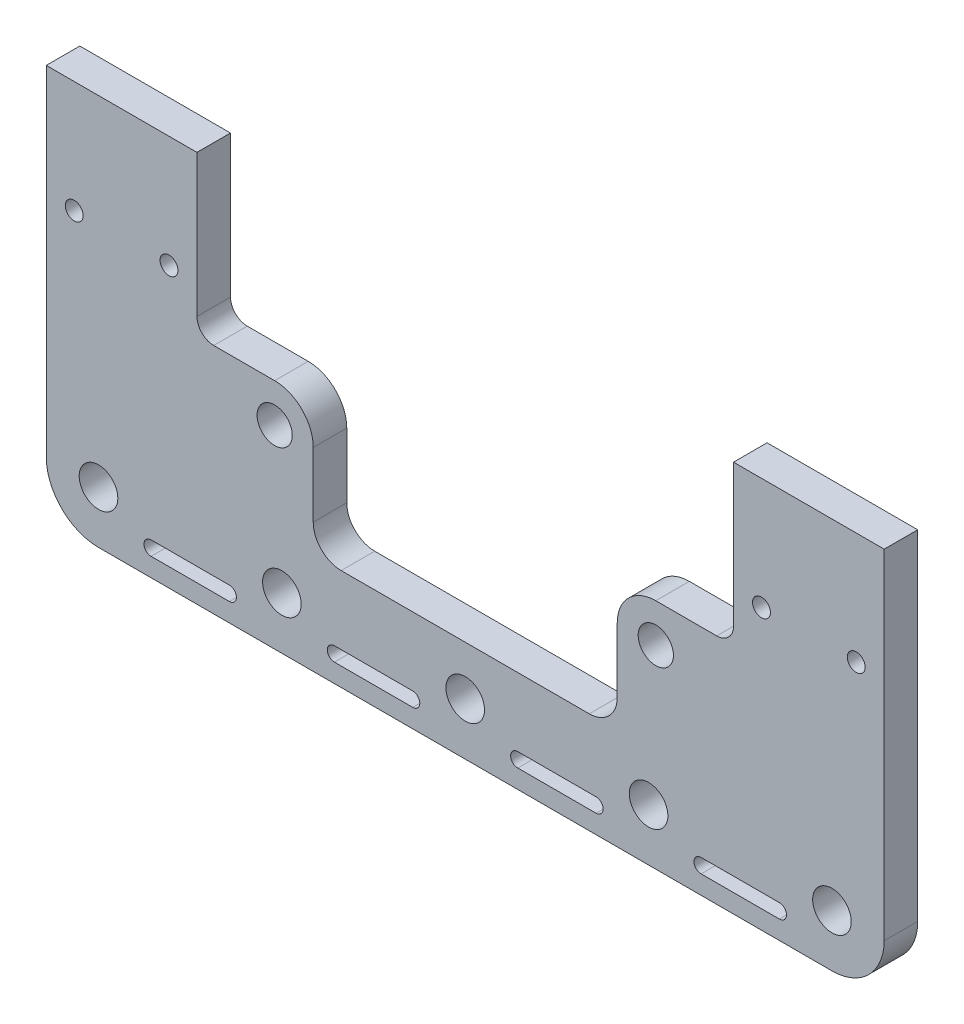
from build123d import *

# Parameters (mm, degrees)
MODEL_R             = 3.15
MODEL_R_2           = 1.6
MODEL_R_3           = 3.452065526
BOSS_EXTRUDE1_DEPTH = 6


with BuildPart() as part:
    # Model → Boss-Extrude1 (new body)
    with BuildSketch(Plane.XY):
        with BuildLine():
            Line((272.99041559, 270.71720563), (272.99041559, 210.062171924))
            ThreePointArc((272.99041559, 210.062171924), (270.253338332, 203.454282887), (263.645449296, 200.71720563))
            Line((263.645449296, 200.71720563), (132.465378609, 200.71720563))
            ThreePointArc((132.465378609, 200.71720563), (125.857489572, 203.454282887), (123.120412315, 210.062171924))
            Line((123.120412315, 210.062171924), (123.120412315, 270.71720563))
            Line((123.120412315, 270.71720563), (150.070412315, 270.71720563))
            Line((150.070412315, 270.71720563), (150.070412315, 245.302023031))
            ThreePointArc((150.070412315, 245.302023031), (150.949091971, 243.180702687), (153.070412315, 242.302023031))
            Line((153.070412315, 242.302023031), (163.970280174, 242.302023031))
            ThreePointArc((163.970280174, 242.302023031), (168.849316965, 240.281059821), (170.870280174, 235.402023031))
            Line((170.870280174, 235.402023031), (170.870280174, 223.837022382))
            ThreePointArc((170.870280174, 223.837022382), (172.334746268, 220.301488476), (175.870280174, 218.837022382))
            Line((175.870280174, 218.837022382), (220.240547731, 218.837022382))
            ThreePointArc((220.240547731, 218.837022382), (223.776081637, 220.301488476), (225.240547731, 223.837022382))
            Line((225.240547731, 223.837022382), (225.240547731, 235.402023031))
            ThreePointArc((225.240547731, 235.402023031), (227.26151094, 240.281059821), (232.140547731, 242.302023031))
            Line((232.140547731, 242.302023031), (243.04041559, 242.302023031))
            ThreePointArc((243.04041559, 242.302023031), (245.161735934, 243.180702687), (246.04041559, 245.302023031))
            Line((246.04041559, 245.302023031), (246.04041559, 270.71720563))
            Line((246.04041559, 270.71720563), (272.99041559, 270.71720563))
        make_face()
        with Locations((163.970280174, 235.402023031)):
            Circle(MODEL_R, mode=Mode.SUBTRACT)
        with Locations((232.140547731, 235.402023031)):
            Circle(MODEL_R, mode=Mode.SUBTRACT)
        with Locations((128.120412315, 250.71720563)):
            Circle(MODEL_R_2, mode=Mode.SUBTRACT)
        with Locations((145.070412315, 250.71720563)):
            Circle(MODEL_R_2, mode=Mode.SUBTRACT)
        with Locations((251.04041559, 250.71720563)):
            Circle(MODEL_R_2, mode=Mode.SUBTRACT)
        with Locations((267.99041559, 250.71720563)):
            Circle(MODEL_R_2, mode=Mode.SUBTRACT)
        with Locations((132.465378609, 210.062171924)):
            Circle(MODEL_R_3, mode=Mode.SUBTRACT)
        with Locations((263.645449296, 210.062171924)):
            Circle(MODEL_R_3, mode=Mode.SUBTRACT)
        with Locations((198.055413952, 210.062171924)):
            Circle(MODEL_R_3, mode=Mode.SUBTRACT)
        with Locations((165.260396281, 210.062171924)):
            Circle(MODEL_R_3, mode=Mode.SUBTRACT)
        with Locations((230.850431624, 210.062171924)):
            Circle(MODEL_R_3, mode=Mode.SUBTRACT)
        with BuildLine():
            Line((141.86157019, 206.588898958), (155.8642047, 206.588898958))
            ThreePointArc((155.8642047, 206.588898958), (157.135095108, 205.31800855), (155.8642047, 204.047118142))
            Line((155.8642047, 204.047118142), (141.86157019, 204.047118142))
            ThreePointArc((141.86157019, 204.047118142), (140.590679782, 205.31800855), (141.86157019, 206.588898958))
        make_face(mode=Mode.SUBTRACT)
        with BuildLine():
            Line((174.656587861, 206.588898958), (188.659222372, 206.588898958))
            ThreePointArc((188.659222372, 206.588898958), (189.93011278, 205.31800855), (188.659222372, 204.047118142))
            Line((188.659222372, 204.047118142), (174.656587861, 204.047118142))
            ThreePointArc((174.656587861, 204.047118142), (173.385697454, 205.31800855), (174.656587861, 206.588898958))
        make_face(mode=Mode.SUBTRACT)
        with BuildLine():
            Line((221.454240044, 206.588898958), (207.451605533, 206.588898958))
            ThreePointArc((207.451605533, 206.588898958), (206.180715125, 205.31800855), (207.451605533, 204.047118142))
            Line((207.451605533, 204.047118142), (221.454240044, 204.047118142))
            ThreePointArc((221.454240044, 204.047118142), (222.725130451, 205.31800855), (221.454240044, 206.588898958))
        make_face(mode=Mode.SUBTRACT)
        with BuildLine():
            Line((254.249257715, 206.588898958), (240.246623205, 206.588898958))
            ThreePointArc((240.246623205, 206.588898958), (238.975732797, 205.31800855), (240.246623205, 204.047118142))
            Line((240.246623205, 204.047118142), (254.249257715, 204.047118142))
            ThreePointArc((254.249257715, 204.047118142), (255.520148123, 205.31800855), (254.249257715, 206.588898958))
        make_face(mode=Mode.SUBTRACT)
    extrude(amount=BOSS_EXTRUDE1_DEPTH)


solid = part.part
